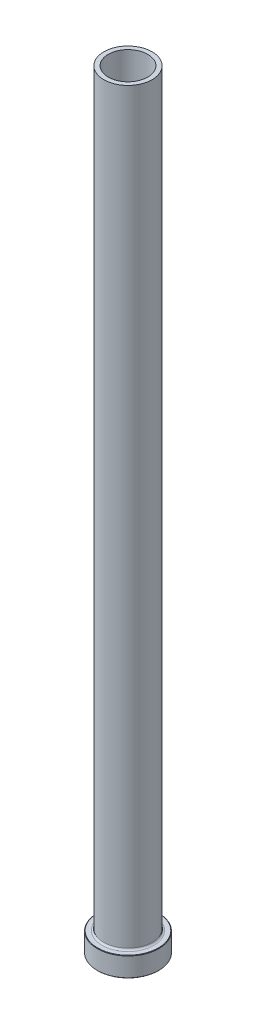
ISO-10303-21;
HEADER;
FILE_DESCRIPTION(('STEP AP214'),'2;1');
FILE_NAME('part.step','',(''),(''),'','','');
FILE_SCHEMA(('AUTOMOTIVE_DESIGN { 1 0 10303 214 1 1 1 1 }'));
ENDSEC;
DATA;
#1=APPLICATION_CONTEXT('core data for automotive mechanical design processes');
#2=APPLICATION_PROTOCOL_DEFINITION('international standard','automotive_design',2000,#1);
#3=PRODUCT_CONTEXT('',#1,'mechanical');
#4=PRODUCT('Part','Part','',(#3));
#5=PRODUCT_RELATED_PRODUCT_CATEGORY('part','',(#4));
#6=PRODUCT_DEFINITION_FORMATION('','',#4);
#7=PRODUCT_DEFINITION_CONTEXT('part definition',#1,'design');
#8=PRODUCT_DEFINITION('design','',#6,#7);
#9=PRODUCT_DEFINITION_SHAPE('','',#8);
#10=(LENGTH_UNIT() NAMED_UNIT(*) SI_UNIT(.MILLI.,.METRE.));
#11=(NAMED_UNIT(*) PLANE_ANGLE_UNIT() SI_UNIT($,.RADIAN.));
#12=(NAMED_UNIT(*) SI_UNIT($,.STERADIAN.) SOLID_ANGLE_UNIT());
#13=UNCERTAINTY_MEASURE_WITH_UNIT(LENGTH_MEASURE(1.E-05),#10,'distance_accuracy_value','');
#14=(GEOMETRIC_REPRESENTATION_CONTEXT(3) GLOBAL_UNCERTAINTY_ASSIGNED_CONTEXT((#13)) GLOBAL_UNIT_ASSIGNED_CONTEXT((#10,
#11,#12)) REPRESENTATION_CONTEXT('',''));
#15=CARTESIAN_POINT('',(0.,0.,0.));
#16=DIRECTION('',(0.,0.,1.));
#17=DIRECTION('',(1.,0.,0.));
#18=AXIS2_PLACEMENT_3D('',#15,#16,#17);
#19=CARTESIAN_POINT('',(0.,92.1876809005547,0.));
#20=DIRECTION('',(0.,1.,0.));
#21=DIRECTION('',(0.,0.,1.));
#22=AXIS2_PLACEMENT_3D('',#19,#20,#21);
#23=CYLINDRICAL_SURFACE('',#22,9.00000000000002);
#24=CARTESIAN_POINT('',(0.,350.,0.));
#25=DIRECTION('',(0.,1.,0.));
#26=DIRECTION('',(0.,0.,1.));
#27=AXIS2_PLACEMENT_3D('',#24,#25,#26);
#28=CIRCLE('',#27,9.00000000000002);
#29=CARTESIAN_POINT('',(0.,350.,9.00000000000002));
#30=VERTEX_POINT('',#29);
#31=EDGE_CURVE('E62',#30,#30,#28,.T.);
#32=ORIENTED_EDGE('',*,*,#31,.T.);
#33=EDGE_LOOP('',(#32));
#34=FACE_BOUND('',#33,.T.);
#35=CARTESIAN_POINT('',(0.,295.,0.));
#36=DIRECTION('',(0.,1.,0.));
#37=DIRECTION('',(0.,0.,1.));
#38=AXIS2_PLACEMENT_3D('',#35,#36,#37);
#39=CIRCLE('',#38,9.00000000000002);
#40=CARTESIAN_POINT('',(0.,295.,9.00000000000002));
#41=VERTEX_POINT('',#40);
#42=EDGE_CURVE('E71',#41,#41,#39,.T.);
#43=ORIENTED_EDGE('',*,*,#42,.F.);
#44=EDGE_LOOP('',(#43));
#45=FACE_BOUND('',#44,.T.);
#46=ADVANCED_FACE('F30',(#34,#45),#23,.F.);
#47=CARTESIAN_POINT('',(-9.00000000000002,350.,0.));
#48=DIRECTION('',(0.,1.,0.));
#49=DIRECTION('',(0.,0.,1.));
#50=AXIS2_PLACEMENT_3D('',#47,#48,#49);
#51=PLANE('',#50);
#52=CARTESIAN_POINT('',(0.,350.,0.));
#53=DIRECTION('',(0.,1.,0.));
#54=DIRECTION('',(0.,0.,1.));
#55=AXIS2_PLACEMENT_3D('',#52,#53,#54);
#56=CIRCLE('',#55,11.);
#57=CARTESIAN_POINT('',(0.,350.,11.));
#58=VERTEX_POINT('',#57);
#59=EDGE_CURVE('E65',#58,#58,#56,.T.);
#60=ORIENTED_EDGE('',*,*,#59,.T.);
#61=EDGE_LOOP('',(#60));
#62=FACE_BOUND('',#61,.T.);
#63=ORIENTED_EDGE('',*,*,#31,.F.);
#64=EDGE_LOOP('',(#63));
#65=FACE_BOUND('',#64,.T.);
#66=ADVANCED_FACE('F79',(#62,#65),#51,.T.);
#67=CARTESIAN_POINT('',(0.,92.1876809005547,0.));
#68=DIRECTION('',(0.,1.,0.));
#69=DIRECTION('',(0.,0.,1.));
#70=AXIS2_PLACEMENT_3D('',#67,#68,#69);
#71=CYLINDRICAL_SURFACE('',#70,11.);
#72=CARTESIAN_POINT('',(0.,9.8,0.));
#73=DIRECTION('',(0.,1.,0.));
#74=DIRECTION('',(0.,0.,1.));
#75=AXIS2_PLACEMENT_3D('',#72,#73,#74);
#76=CIRCLE('',#75,11.);
#77=CARTESIAN_POINT('',(0.,9.8,11.));
#78=VERTEX_POINT('',#77);
#79=EDGE_CURVE('E59',#78,#78,#76,.T.);
#80=ORIENTED_EDGE('',*,*,#79,.T.);
#81=EDGE_LOOP('',(#80));
#82=FACE_BOUND('',#81,.T.);
#83=ORIENTED_EDGE('',*,*,#59,.F.);
#84=EDGE_LOOP('',(#83));
#85=FACE_BOUND('',#84,.T.);
#86=ADVANCED_FACE('F85',(#82,#85),#71,.T.);
#87=CARTESIAN_POINT('',(-11.,9.,0.));
#88=DIRECTION('',(0.,1.,0.));
#89=DIRECTION('',(0.,0.,1.));
#90=AXIS2_PLACEMENT_3D('',#87,#88,#89);
#91=PLANE('',#90);
#92=CARTESIAN_POINT('',(0.,9.,0.));
#93=DIRECTION('',(0.,1.,0.));
#94=DIRECTION('',(0.,0.,1.));
#95=AXIS2_PLACEMENT_3D('',#92,#93,#94);
#96=CIRCLE('',#95,13.7999999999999);
#97=CARTESIAN_POINT('',(0.,9.,13.7999999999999));
#98=VERTEX_POINT('',#97);
#99=EDGE_CURVE('E53',#98,#98,#96,.T.);
#100=ORIENTED_EDGE('',*,*,#99,.T.);
#101=EDGE_LOOP('',(#100));
#102=FACE_BOUND('',#101,.T.);
#103=CARTESIAN_POINT('',(0.,9.,0.));
#104=DIRECTION('',(0.,1.,0.));
#105=DIRECTION('',(0.,0.,1.));
#106=AXIS2_PLACEMENT_3D('',#103,#104,#105);
#107=CIRCLE('',#106,11.8);
#108=CARTESIAN_POINT('',(0.,9.,11.8));
#109=VERTEX_POINT('',#108);
#110=EDGE_CURVE('E56',#109,#109,#107,.F.);
#111=ORIENTED_EDGE('',*,*,#110,.T.);
#112=EDGE_LOOP('',(#111));
#113=FACE_BOUND('',#112,.T.);
#114=ADVANCED_FACE('F111',(#102,#113),#91,.T.);
#115=CARTESIAN_POINT('',(0.,92.1876809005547,0.));
#116=DIRECTION('',(0.,1.,0.));
#117=DIRECTION('',(0.,0.,1.));
#118=AXIS2_PLACEMENT_3D('',#115,#116,#117);
#119=CYLINDRICAL_SURFACE('',#118,14.);
#120=CARTESIAN_POINT('',(0.,8.79999999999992,0.));
#121=DIRECTION('',(0.,1.,0.));
#122=DIRECTION('',(0.,0.,1.));
#123=AXIS2_PLACEMENT_3D('',#120,#121,#122);
#124=CIRCLE('',#123,14.);
#125=CARTESIAN_POINT('',(0.,8.79999999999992,14.));
#126=VERTEX_POINT('',#125);
#127=EDGE_CURVE('E45',#126,#126,#124,.F.);
#128=ORIENTED_EDGE('',*,*,#127,.T.);
#129=EDGE_LOOP('',(#128));
#130=FACE_BOUND('',#129,.T.);
#131=CARTESIAN_POINT('',(0.,0.200000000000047,0.));
#132=DIRECTION('',(0.,-1.,0.));
#133=DIRECTION('',(0.,0.,-1.));
#134=AXIS2_PLACEMENT_3D('',#131,#132,#133);
#135=CIRCLE('',#134,14.);
#136=CARTESIAN_POINT('',(0.,0.200000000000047,-14.));
#137=VERTEX_POINT('',#136);
#138=EDGE_CURVE('E50',#137,#137,#135,.F.);
#139=ORIENTED_EDGE('',*,*,#138,.T.);
#140=EDGE_LOOP('',(#139));
#141=FACE_BOUND('',#140,.T.);
#142=ADVANCED_FACE('F108',(#130,#141),#119,.T.);
#143=CARTESIAN_POINT('',(-14.,0.,0.));
#144=DIRECTION('',(0.,-1.,0.));
#145=DIRECTION('',(0.,0.,-1.));
#146=AXIS2_PLACEMENT_3D('',#143,#144,#145);
#147=PLANE('',#146);
#148=CARTESIAN_POINT('',(0.,0.,0.));
#149=DIRECTION('',(0.,-1.,0.));
#150=DIRECTION('',(0.,0.,-1.));
#151=AXIS2_PLACEMENT_3D('',#148,#149,#150);
#152=CIRCLE('',#151,9.75000000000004);
#153=CARTESIAN_POINT('',(0.,0.,-9.75000000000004));
#154=VERTEX_POINT('',#153);
#155=EDGE_CURVE('E37',#154,#154,#152,.F.);
#156=ORIENTED_EDGE('',*,*,#155,.T.);
#157=EDGE_LOOP('',(#156));
#158=FACE_BOUND('',#157,.T.);
#159=CARTESIAN_POINT('',(0.,0.,0.));
#160=DIRECTION('',(0.,-1.,0.));
#161=DIRECTION('',(0.,0.,-1.));
#162=AXIS2_PLACEMENT_3D('',#159,#160,#161);
#163=CIRCLE('',#162,13.7999999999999);
#164=CARTESIAN_POINT('',(0.,0.,-13.7999999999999));
#165=VERTEX_POINT('',#164);
#166=EDGE_CURVE('E41',#165,#165,#163,.T.);
#167=ORIENTED_EDGE('',*,*,#166,.T.);
#168=EDGE_LOOP('',(#167));
#169=FACE_BOUND('',#168,.T.);
#170=ADVANCED_FACE('F110',(#158,#169),#147,.T.);
#171=CARTESIAN_POINT('',(0.,92.1876809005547,0.));
#172=DIRECTION('',(0.,1.,0.));
#173=DIRECTION('',(0.,0.,1.));
#174=AXIS2_PLACEMENT_3D('',#171,#172,#173);
#175=CYLINDRICAL_SURFACE('',#174,9.25000000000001);
#176=CARTESIAN_POINT('',(0.,0.500000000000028,0.));
#177=DIRECTION('',(0.,-1.,0.));
#178=DIRECTION('',(0.,0.,-1.));
#179=AXIS2_PLACEMENT_3D('',#176,#177,#178);
#180=CIRCLE('',#179,9.25000000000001);
#181=CARTESIAN_POINT('',(0.,0.500000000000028,-9.25000000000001));
#182=VERTEX_POINT('',#181);
#183=EDGE_CURVE('E10',#182,#182,#180,.T.);
#184=ORIENTED_EDGE('',*,*,#183,.T.);
#185=EDGE_LOOP('',(#184));
#186=FACE_BOUND('',#185,.T.);
#187=CARTESIAN_POINT('',(0.,283.,0.));
#188=DIRECTION('',(0.,1.,0.));
#189=DIRECTION('',(0.,0.,1.));
#190=AXIS2_PLACEMENT_3D('',#187,#188,#189);
#191=CIRCLE('',#190,9.25000000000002);
#192=CARTESIAN_POINT('',(0.,283.,9.25000000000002));
#193=VERTEX_POINT('',#192);
#194=EDGE_CURVE('E68',#193,#193,#191,.T.);
#195=ORIENTED_EDGE('',*,*,#194,.T.);
#196=EDGE_LOOP('',(#195));
#197=FACE_BOUND('',#196,.T.);
#198=ADVANCED_FACE('F118',(#186,#197),#175,.F.);
#199=CARTESIAN_POINT('',(0.,283.,0.));
#200=DIRECTION('',(0.,-1.,0.));
#201=DIRECTION('',(0.,0.,-1.));
#202=AXIS2_PLACEMENT_3D('',#199,#200,#201);
#203=CONICAL_SURFACE('',#202,9.25000000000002,0.0208303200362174);
#204=ORIENTED_EDGE('',*,*,#42,.T.);
#205=EDGE_LOOP('',(#204));
#206=FACE_BOUND('',#205,.T.);
#207=ORIENTED_EDGE('',*,*,#194,.F.);
#208=EDGE_LOOP('',(#207));
#209=FACE_BOUND('',#208,.T.);
#210=ADVANCED_FACE('F75',(#206,#209),#203,.F.);
#211=CARTESIAN_POINT('',(0.,9.8,0.));
#212=DIRECTION('',(0.,1.,0.));
#213=DIRECTION('',(0.,0.,1.));
#214=AXIS2_PLACEMENT_3D('',#211,#212,#213);
#215=TOROIDAL_SURFACE('',#214,11.8,0.8);
#216=ORIENTED_EDGE('',*,*,#110,.F.);
#217=EDGE_LOOP('',(#216));
#218=FACE_BOUND('',#217,.T.);
#219=ORIENTED_EDGE('',*,*,#79,.F.);
#220=EDGE_LOOP('',(#219));
#221=FACE_BOUND('',#220,.T.);
#222=ADVANCED_FACE('F90',(#218,#221),#215,.F.);
#223=CARTESIAN_POINT('',(0.,8.99999999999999,0.));
#224=DIRECTION('',(0.,-1.,0.));
#225=DIRECTION('',(0.,0.,-1.));
#226=AXIS2_PLACEMENT_3D('',#223,#224,#225);
#227=CONICAL_SURFACE('',#226,13.7999999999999,0.785398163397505);
#228=ORIENTED_EDGE('',*,*,#127,.F.);
#229=EDGE_LOOP('',(#228));
#230=FACE_BOUND('',#229,.T.);
#231=ORIENTED_EDGE('',*,*,#99,.F.);
#232=EDGE_LOOP('',(#231));
#233=FACE_BOUND('',#232,.T.);
#234=ADVANCED_FACE('F93',(#230,#233),#227,.T.);
#235=CARTESIAN_POINT('',(0.,0.200000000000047,0.));
#236=DIRECTION('',(0.,1.,0.));
#237=DIRECTION('',(0.,0.,1.));
#238=AXIS2_PLACEMENT_3D('',#235,#236,#237);
#239=CONICAL_SURFACE('',#238,14.,0.785398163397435);
#240=ORIENTED_EDGE('',*,*,#166,.F.);
#241=EDGE_LOOP('',(#240));
#242=FACE_BOUND('',#241,.T.);
#243=ORIENTED_EDGE('',*,*,#138,.F.);
#244=EDGE_LOOP('',(#243));
#245=FACE_BOUND('',#244,.T.);
#246=ADVANCED_FACE('F96',(#242,#245),#239,.T.);
#247=CARTESIAN_POINT('',(0.,0.,0.));
#248=DIRECTION('',(0.,-1.,0.));
#249=DIRECTION('',(0.,0.,-1.));
#250=AXIS2_PLACEMENT_3D('',#247,#248,#249);
#251=CONICAL_SURFACE('',#250,9.75000000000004,0.785398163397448);
#252=ORIENTED_EDGE('',*,*,#183,.F.);
#253=EDGE_LOOP('',(#252));
#254=FACE_BOUND('',#253,.T.);
#255=ORIENTED_EDGE('',*,*,#155,.F.);
#256=EDGE_LOOP('',(#255));
#257=FACE_BOUND('',#256,.T.);
#258=ADVANCED_FACE('F32',(#254,#257),#251,.F.);
#259=CLOSED_SHELL('',(#46,#66,#86,#114,#142,#170,#198,#210,#222,#234,#246,#258));
#260=MANIFOLD_SOLID_BREP('B2',#259);
#261=ADVANCED_BREP_SHAPE_REPRESENTATION('',(#18,#260),#14);
#262=SHAPE_DEFINITION_REPRESENTATION(#9,#261);
ENDSEC;
END-ISO-10303-21;
